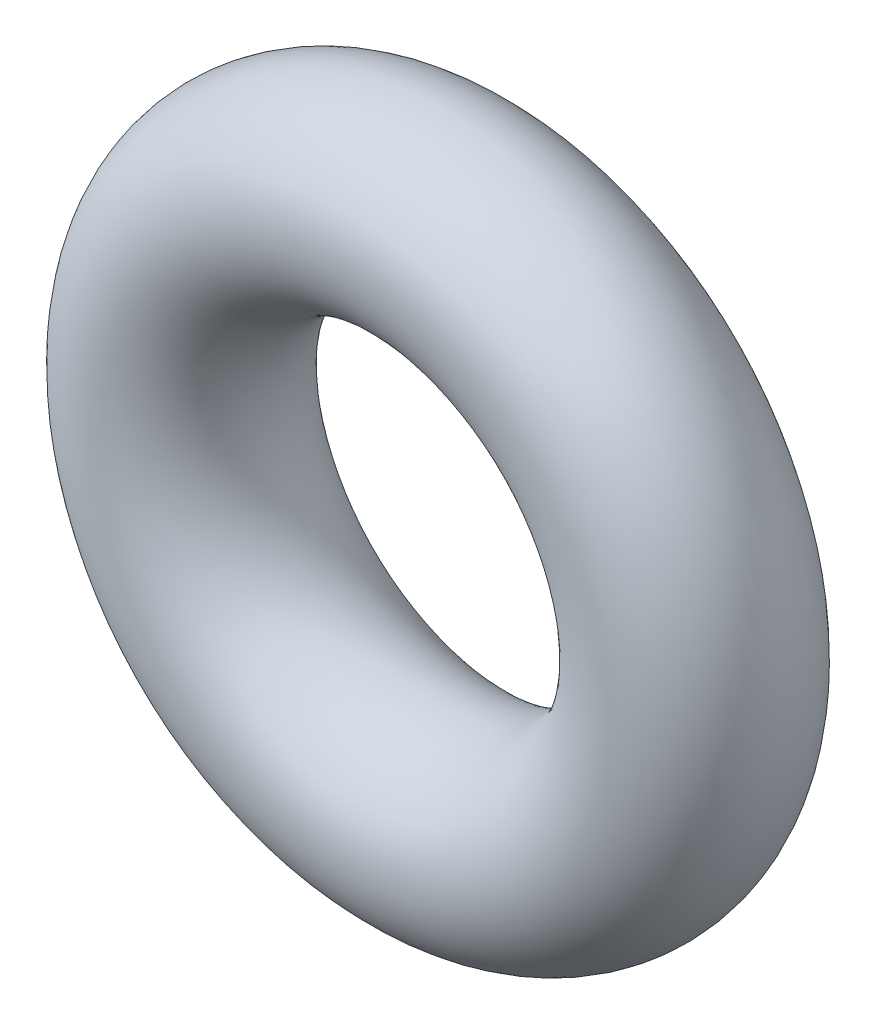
ISO-10303-21;
HEADER;
FILE_DESCRIPTION(('STEP AP214'),'2;1');
FILE_NAME('part.step','',(''),(''),'','','');
FILE_SCHEMA(('AUTOMOTIVE_DESIGN { 1 0 10303 214 1 1 1 1 }'));
ENDSEC;
DATA;
#1=APPLICATION_CONTEXT('core data for automotive mechanical design processes');
#2=APPLICATION_PROTOCOL_DEFINITION('international standard','automotive_design',2000,#1);
#3=PRODUCT_CONTEXT('',#1,'mechanical');
#4=PRODUCT('Part','Part','',(#3));
#5=PRODUCT_RELATED_PRODUCT_CATEGORY('part','',(#4));
#6=PRODUCT_DEFINITION_FORMATION('','',#4);
#7=PRODUCT_DEFINITION_CONTEXT('part definition',#1,'design');
#8=PRODUCT_DEFINITION('design','',#6,#7);
#9=PRODUCT_DEFINITION_SHAPE('','',#8);
#10=(LENGTH_UNIT() NAMED_UNIT(*) SI_UNIT(.MILLI.,.METRE.));
#11=(NAMED_UNIT(*) PLANE_ANGLE_UNIT() SI_UNIT($,.RADIAN.));
#12=(NAMED_UNIT(*) SI_UNIT($,.STERADIAN.) SOLID_ANGLE_UNIT());
#13=UNCERTAINTY_MEASURE_WITH_UNIT(LENGTH_MEASURE(1.E-05),#10,'distance_accuracy_value','');
#14=(GEOMETRIC_REPRESENTATION_CONTEXT(3) GLOBAL_UNCERTAINTY_ASSIGNED_CONTEXT((#13)) GLOBAL_UNIT_ASSIGNED_CONTEXT((#10,
#11,#12)) REPRESENTATION_CONTEXT('',''));
#15=CARTESIAN_POINT('',(0.,0.,0.));
#16=DIRECTION('',(0.,0.,1.));
#17=DIRECTION('',(1.,0.,0.));
#18=AXIS2_PLACEMENT_3D('',#15,#16,#17);
#19=CARTESIAN_POINT('',(0.,0.,0.));
#20=DIRECTION('',(0.,0.,1.));
#21=DIRECTION('',(1.,0.,0.));
#22=AXIS2_PLACEMENT_3D('',#19,#20,#21);
#23=TOROIDAL_SURFACE('',#22,3.5179,1.3081);
#24=CARTESIAN_POINT('',(4.826,0.,0.));
#25=VERTEX_POINT('',#24);
#26=VERTEX_LOOP('',#25);
#27=FACE_BOUND('',#26,.T.);
#28=ADVANCED_FACE('F33',(#27),#23,.T.);
#29=CLOSED_SHELL('',(#28));
#30=MANIFOLD_SOLID_BREP('B2',#29);
#31=ADVANCED_BREP_SHAPE_REPRESENTATION('',(#18,#30),#14);
#32=SHAPE_DEFINITION_REPRESENTATION(#9,#31);
ENDSEC;
END-ISO-10303-21;
